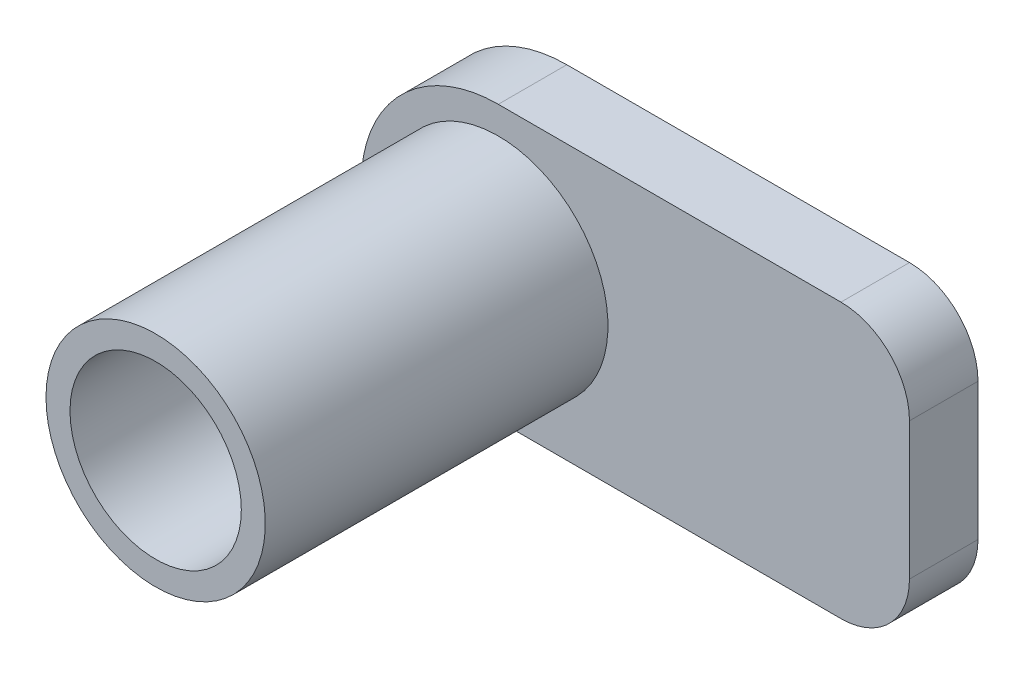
from build123d import *

# Parameters (mm, degrees)
BOSS_EXTRUDE1_DEPTH = 254
SKETCH2_R           = 406.4
BOSS_EXTRUDE2_DEPTH = 1270
SKETCH3_R           = 317.5
CUT_EXTRUDE1_DEPTH  = 762


with BuildPart() as part:
    # Sketch1 → Boss-Extrude1 (new body)
    with BuildSketch(Plane.XY):
        with BuildLine():
            Line((-1778, -778.565217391), (-1778, -270.565217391))
            ThreePointArc((-1778, -270.565217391), (-1852.394877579, -90.96009497), (-2032, -16.565217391))
            Line((-2032, -16.565217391), (-3302, -16.565217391))
            ThreePointArc((-3302, -16.565217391), (-3810, -524.565217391), (-3302, -1032.565217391))
            Line((-3302, -1032.565217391), (-2032, -1032.565217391))
            ThreePointArc((-2032, -1032.565217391), (-1852.394877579, -958.170339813), (-1778, -778.565217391))
        make_face()
    extrude(amount=BOSS_EXTRUDE1_DEPTH)

    # Sketch2 → Boss-Extrude2 (add)
    with BuildSketch(Plane.XY.offset(254)):
        with Locations(Location((-3302, -524.565217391, 0), (0, 0, 180))):
            Circle(SKETCH2_R)
    extrude(amount=BOSS_EXTRUDE2_DEPTH)

    # Sketch3 → Cut-Extrude1 (cut)
    with BuildSketch(Plane.XY.offset(1524)):
        with Locations((-3302, -524.565217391)):
            Circle(SKETCH3_R)
    extrude(amount=-CUT_EXTRUDE1_DEPTH, mode=Mode.SUBTRACT)


solid = part.part
